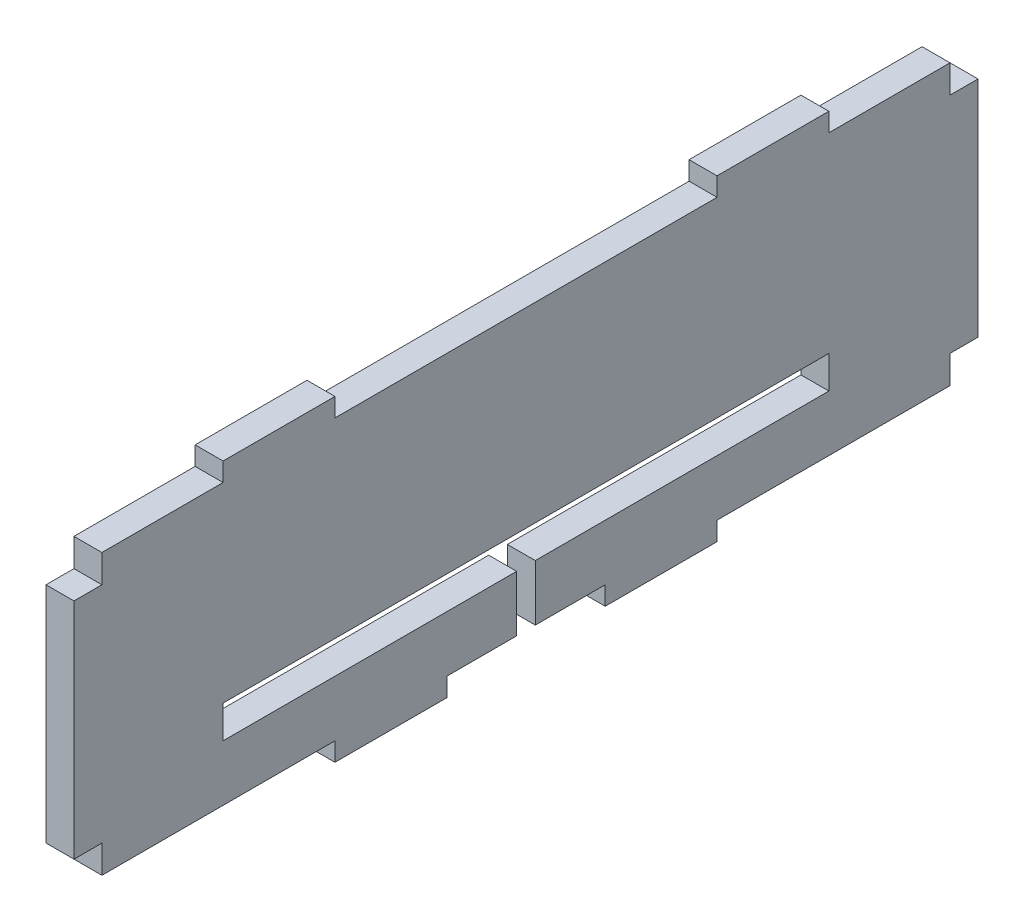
from build123d import *

# Parameters (mm, degrees)
BOSS_EXTRUDE1_DEPTH = 3


with BuildPart() as part:
    # Sketch1 → Boss-Extrude1 (new body)
    with BuildSketch(Plane(origin=(0, 0, 0), x_dir=(0, 0, -1), z_dir=(1, 0, 0))):
        Polygon((28, 2), (28, 0), (40, 0), (40, 2), (47.5, 2), (47.5, 8), (16, 8), (16, 11.5), (81, 11.5), (81, 8), (49.5, 8), (49.5, 2), (57, 2), (57, 0), (69, 0), (69, 2), (94, 2), (94, 5), (97, 5), (97, 29), (94, 29), (94, 32), (81, 32), (81, 34), (69, 34), (69, 32), (28, 32), (28, 34), (16, 34), (16, 32), (3, 32), (3, 29), (0, 29), (0, 5), (3, 5), (3, 2), align=None)
    extrude(amount=BOSS_EXTRUDE1_DEPTH)


solid = part.part
